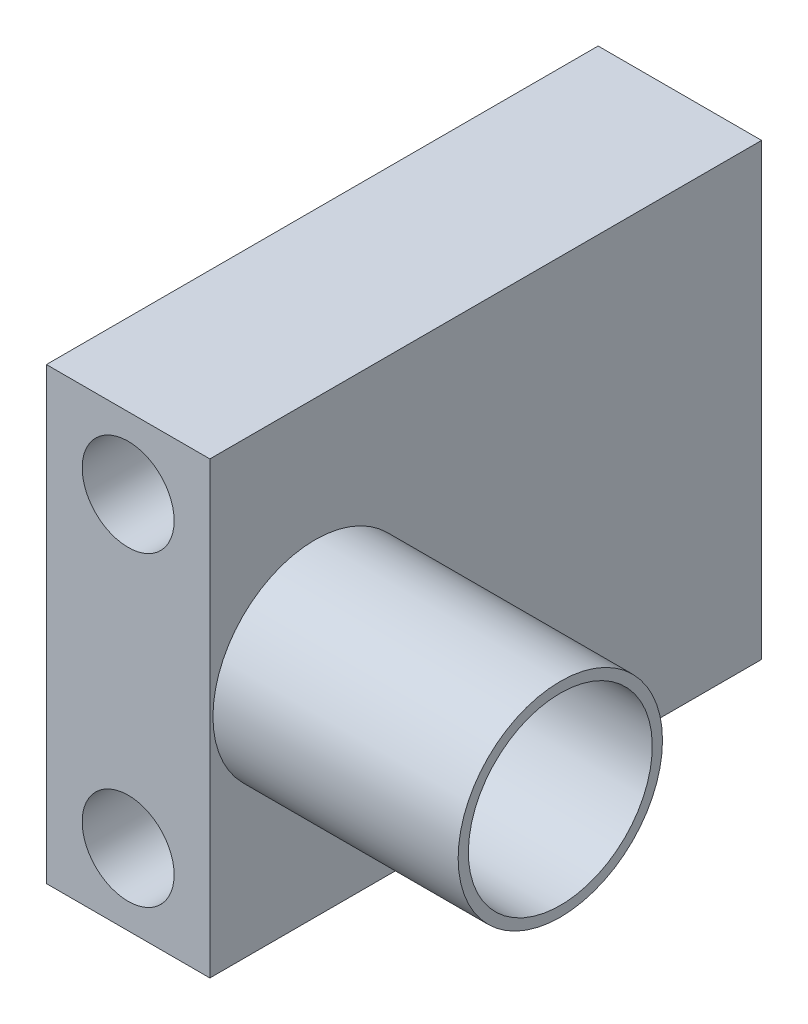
ISO-10303-21;
HEADER;
FILE_DESCRIPTION(('STEP AP214'),'2;1');
FILE_NAME('part.step','',(''),(''),'','','');
FILE_SCHEMA(('AUTOMOTIVE_DESIGN { 1 0 10303 214 1 1 1 1 }'));
ENDSEC;
DATA;
#1=APPLICATION_CONTEXT('core data for automotive mechanical design processes');
#2=APPLICATION_PROTOCOL_DEFINITION('international standard','automotive_design',2000,#1);
#3=PRODUCT_CONTEXT('',#1,'mechanical');
#4=PRODUCT('Part','Part','',(#3));
#5=PRODUCT_RELATED_PRODUCT_CATEGORY('part','',(#4));
#6=PRODUCT_DEFINITION_FORMATION('','',#4);
#7=PRODUCT_DEFINITION_CONTEXT('part definition',#1,'design');
#8=PRODUCT_DEFINITION('design','',#6,#7);
#9=PRODUCT_DEFINITION_SHAPE('','',#8);
#10=(LENGTH_UNIT() NAMED_UNIT(*) SI_UNIT(.MILLI.,.METRE.));
#11=(NAMED_UNIT(*) PLANE_ANGLE_UNIT() SI_UNIT($,.RADIAN.));
#12=(NAMED_UNIT(*) SI_UNIT($,.STERADIAN.) SOLID_ANGLE_UNIT());
#13=UNCERTAINTY_MEASURE_WITH_UNIT(LENGTH_MEASURE(1.E-05),#10,'distance_accuracy_value','');
#14=(GEOMETRIC_REPRESENTATION_CONTEXT(3) GLOBAL_UNCERTAINTY_ASSIGNED_CONTEXT((#13)) GLOBAL_UNIT_ASSIGNED_CONTEXT((#10,
#11,#12)) REPRESENTATION_CONTEXT('',''));
#15=CARTESIAN_POINT('',(0.,0.,0.));
#16=DIRECTION('',(0.,0.,1.));
#17=DIRECTION('',(1.,0.,0.));
#18=AXIS2_PLACEMENT_3D('',#15,#16,#17);
#19=CARTESIAN_POINT('',(8.,37.,54.));
#20=DIRECTION('',(-1.,0.,0.));
#21=DIRECTION('',(0.,-1.,0.));
#22=AXIS2_PLACEMENT_3D('',#19,#20,#21);
#23=PLANE('',#22);
#24=DIRECTION('',(0.,1.,0.));
#25=VECTOR('',#24,1.);
#26=CARTESIAN_POINT('',(8.,37.,0.));
#27=LINE('',#26,#25);
#28=CARTESIAN_POINT('',(8.,-7.,0.));
#29=VERTEX_POINT('',#28);
#30=CARTESIAN_POINT('',(8.,37.,0.));
#31=VERTEX_POINT('',#30);
#32=EDGE_CURVE('E62',#29,#31,#27,.T.);
#33=ORIENTED_EDGE('',*,*,#32,.T.);
#34=DIRECTION('',(0.,0.,-1.));
#35=VECTOR('',#34,1.);
#36=CARTESIAN_POINT('',(8.,37.,54.));
#37=LINE('',#36,#35);
#38=CARTESIAN_POINT('',(8.,37.,54.));
#39=VERTEX_POINT('',#38);
#40=EDGE_CURVE('E23',#39,#31,#37,.T.);
#41=ORIENTED_EDGE('',*,*,#40,.F.);
#42=DIRECTION('',(0.,1.,0.));
#43=VECTOR('',#42,1.);
#44=CARTESIAN_POINT('',(8.,37.,54.));
#45=LINE('',#44,#43);
#46=CARTESIAN_POINT('',(8.,-7.,54.));
#47=VERTEX_POINT('',#46);
#48=EDGE_CURVE('E88',#47,#39,#45,.T.);
#49=ORIENTED_EDGE('',*,*,#48,.F.);
#50=DIRECTION('',(0.,0.,-1.));
#51=VECTOR('',#50,1.);
#52=CARTESIAN_POINT('',(8.,-7.,54.));
#53=LINE('',#52,#51);
#54=EDGE_CURVE('E77',#47,#29,#53,.T.);
#55=ORIENTED_EDGE('',*,*,#54,.T.);
#56=EDGE_LOOP('',(#33,#41,#49,#55));
#57=FACE_BOUND('',#56,.T.);
#58=CARTESIAN_POINT('',(8.,15.,43.7));
#59=DIRECTION('',(-1.,0.,0.));
#60=DIRECTION('',(0.,-1.,0.));
#61=AXIS2_PLACEMENT_3D('',#58,#59,#60);
#62=CIRCLE('',#61,10.);
#63=CARTESIAN_POINT('',(8.,5.,43.7));
#64=VERTEX_POINT('',#63);
#65=EDGE_CURVE('E10',#64,#64,#62,.F.);
#66=ORIENTED_EDGE('',*,*,#65,.F.);
#67=EDGE_LOOP('',(#66));
#68=FACE_BOUND('',#67,.T.);
#69=ADVANCED_FACE('F15',(#57,#68),#23,.F.);
#70=CARTESIAN_POINT('',(8.,37.,54.));
#71=DIRECTION('',(0.,0.,-1.));
#72=DIRECTION('',(-1.,0.,0.));
#73=AXIS2_PLACEMENT_3D('',#70,#71,#72);
#74=PLANE('',#73);
#75=CARTESIAN_POINT('',(0.,30.,54.));
#76=DIRECTION('',(0.,0.,1.));
#77=DIRECTION('',(1.,0.,0.));
#78=AXIS2_PLACEMENT_3D('',#75,#76,#77);
#79=CIRCLE('',#78,4.5);
#80=CARTESIAN_POINT('',(4.5,30.,54.));
#81=VERTEX_POINT('',#80);
#82=EDGE_CURVE('E78',#81,#81,#79,.T.);
#83=ORIENTED_EDGE('',*,*,#82,.F.);
#84=EDGE_LOOP('',(#83));
#85=FACE_BOUND('',#84,.T.);
#86=ORIENTED_EDGE('',*,*,#48,.T.);
#87=DIRECTION('',(-1.,0.,0.));
#88=VECTOR('',#87,1.);
#89=CARTESIAN_POINT('',(8.,37.,54.));
#90=LINE('',#89,#88);
#91=CARTESIAN_POINT('',(-8.,37.,54.));
#92=VERTEX_POINT('',#91);
#93=EDGE_CURVE('E70',#39,#92,#90,.T.);
#94=ORIENTED_EDGE('',*,*,#93,.T.);
#95=DIRECTION('',(0.,-1.,0.));
#96=VECTOR('',#95,1.);
#97=CARTESIAN_POINT('',(-8.,37.,54.));
#98=LINE('',#97,#96);
#99=CARTESIAN_POINT('',(-8.,-7.,54.));
#100=VERTEX_POINT('',#99);
#101=EDGE_CURVE('E35',#92,#100,#98,.T.);
#102=ORIENTED_EDGE('',*,*,#101,.T.);
#103=DIRECTION('',(1.,0.,0.));
#104=VECTOR('',#103,1.);
#105=CARTESIAN_POINT('',(8.,-7.,54.));
#106=LINE('',#105,#104);
#107=EDGE_CURVE('E30',#100,#47,#106,.T.);
#108=ORIENTED_EDGE('',*,*,#107,.T.);
#109=EDGE_LOOP('',(#86,#94,#102,#108));
#110=FACE_BOUND('',#109,.T.);
#111=CARTESIAN_POINT('',(0.,0.,54.));
#112=DIRECTION('',(0.,0.,1.));
#113=DIRECTION('',(1.,0.,0.));
#114=AXIS2_PLACEMENT_3D('',#111,#112,#113);
#115=CIRCLE('',#114,4.5);
#116=CARTESIAN_POINT('',(4.5,0.,54.));
#117=VERTEX_POINT('',#116);
#118=EDGE_CURVE('E108',#117,#117,#115,.T.);
#119=ORIENTED_EDGE('',*,*,#118,.F.);
#120=EDGE_LOOP('',(#119));
#121=FACE_BOUND('',#120,.T.);
#122=ADVANCED_FACE('F101',(#85,#110,#121),#74,.F.);
#123=CARTESIAN_POINT('',(8.,37.,0.));
#124=DIRECTION('',(0.,0.,-1.));
#125=DIRECTION('',(-1.,0.,0.));
#126=AXIS2_PLACEMENT_3D('',#123,#124,#125);
#127=PLANE('',#126);
#128=CARTESIAN_POINT('',(0.,30.,0.));
#129=DIRECTION('',(0.,0.,1.));
#130=DIRECTION('',(1.,0.,0.));
#131=AXIS2_PLACEMENT_3D('',#128,#129,#130);
#132=CIRCLE('',#131,4.5);
#133=CARTESIAN_POINT('',(4.5,30.,0.));
#134=VERTEX_POINT('',#133);
#135=EDGE_CURVE('E81',#134,#134,#132,.T.);
#136=ORIENTED_EDGE('',*,*,#135,.T.);
#137=EDGE_LOOP('',(#136));
#138=FACE_BOUND('',#137,.T.);
#139=ORIENTED_EDGE('',*,*,#32,.F.);
#140=DIRECTION('',(1.,0.,0.));
#141=VECTOR('',#140,1.);
#142=CARTESIAN_POINT('',(8.,-7.,0.));
#143=LINE('',#142,#141);
#144=CARTESIAN_POINT('',(-8.,-7.,0.));
#145=VERTEX_POINT('',#144);
#146=EDGE_CURVE('E86',#145,#29,#143,.T.);
#147=ORIENTED_EDGE('',*,*,#146,.F.);
#148=DIRECTION('',(0.,-1.,0.));
#149=VECTOR('',#148,1.);
#150=CARTESIAN_POINT('',(-8.,37.,0.));
#151=LINE('',#150,#149);
#152=CARTESIAN_POINT('',(-8.,37.,0.));
#153=VERTEX_POINT('',#152);
#154=EDGE_CURVE('E63',#153,#145,#151,.T.);
#155=ORIENTED_EDGE('',*,*,#154,.F.);
#156=DIRECTION('',(-1.,0.,0.));
#157=VECTOR('',#156,1.);
#158=CARTESIAN_POINT('',(8.,37.,0.));
#159=LINE('',#158,#157);
#160=EDGE_CURVE('E56',#31,#153,#159,.T.);
#161=ORIENTED_EDGE('',*,*,#160,.F.);
#162=EDGE_LOOP('',(#139,#147,#155,#161));
#163=FACE_BOUND('',#162,.T.);
#164=CARTESIAN_POINT('',(0.,0.,0.));
#165=DIRECTION('',(0.,0.,1.));
#166=DIRECTION('',(1.,0.,0.));
#167=AXIS2_PLACEMENT_3D('',#164,#165,#166);
#168=CIRCLE('',#167,4.5);
#169=CARTESIAN_POINT('',(4.5,0.,0.));
#170=VERTEX_POINT('',#169);
#171=EDGE_CURVE('E110',#170,#170,#168,.T.);
#172=ORIENTED_EDGE('',*,*,#171,.T.);
#173=EDGE_LOOP('',(#172));
#174=FACE_BOUND('',#173,.T.);
#175=ADVANCED_FACE('F58',(#138,#163,#174),#127,.T.);
#176=CARTESIAN_POINT('',(8.,37.,54.));
#177=DIRECTION('',(0.,-1.,0.));
#178=DIRECTION('',(1.,0.,0.));
#179=AXIS2_PLACEMENT_3D('',#176,#177,#178);
#180=PLANE('',#179);
#181=ORIENTED_EDGE('',*,*,#160,.T.);
#182=DIRECTION('',(0.,0.,-1.));
#183=VECTOR('',#182,1.);
#184=CARTESIAN_POINT('',(-8.,37.,54.));
#185=LINE('',#184,#183);
#186=EDGE_CURVE('E73',#92,#153,#185,.T.);
#187=ORIENTED_EDGE('',*,*,#186,.F.);
#188=ORIENTED_EDGE('',*,*,#93,.F.);
#189=ORIENTED_EDGE('',*,*,#40,.T.);
#190=EDGE_LOOP('',(#181,#187,#188,#189));
#191=FACE_BOUND('',#190,.T.);
#192=ADVANCED_FACE('F69',(#191),#180,.F.);
#193=CARTESIAN_POINT('',(-8.,37.,54.));
#194=DIRECTION('',(1.,0.,0.));
#195=DIRECTION('',(0.,1.,0.));
#196=AXIS2_PLACEMENT_3D('',#193,#194,#195);
#197=PLANE('',#196);
#198=CARTESIAN_POINT('',(-8.,15.,43.7));
#199=DIRECTION('',(-1.,0.,0.));
#200=DIRECTION('',(0.,-1.,0.));
#201=AXIS2_PLACEMENT_3D('',#198,#199,#200);
#202=CIRCLE('',#201,6.25);
#203=CARTESIAN_POINT('',(-8.,8.75,43.7));
#204=VERTEX_POINT('',#203);
#205=EDGE_CURVE('E119',#204,#204,#202,.T.);
#206=ORIENTED_EDGE('',*,*,#205,.F.);
#207=EDGE_LOOP('',(#206));
#208=FACE_BOUND('',#207,.T.);
#209=ORIENTED_EDGE('',*,*,#154,.T.);
#210=DIRECTION('',(0.,0.,-1.));
#211=VECTOR('',#210,1.);
#212=CARTESIAN_POINT('',(-8.,-7.,54.));
#213=LINE('',#212,#211);
#214=EDGE_CURVE('E94',#100,#145,#213,.T.);
#215=ORIENTED_EDGE('',*,*,#214,.F.);
#216=ORIENTED_EDGE('',*,*,#101,.F.);
#217=ORIENTED_EDGE('',*,*,#186,.T.);
#218=EDGE_LOOP('',(#209,#215,#216,#217));
#219=FACE_BOUND('',#218,.T.);
#220=ADVANCED_FACE('F98',(#208,#219),#197,.F.);
#221=CARTESIAN_POINT('',(8.,-7.,54.));
#222=DIRECTION('',(0.,1.,0.));
#223=DIRECTION('',(0.,0.,1.));
#224=AXIS2_PLACEMENT_3D('',#221,#222,#223);
#225=PLANE('',#224);
#226=ORIENTED_EDGE('',*,*,#146,.T.);
#227=ORIENTED_EDGE('',*,*,#54,.F.);
#228=ORIENTED_EDGE('',*,*,#107,.F.);
#229=ORIENTED_EDGE('',*,*,#214,.T.);
#230=EDGE_LOOP('',(#226,#227,#228,#229));
#231=FACE_BOUND('',#230,.T.);
#232=ADVANCED_FACE('F100',(#231),#225,.F.);
#233=CARTESIAN_POINT('',(0.,30.,54.));
#234=DIRECTION('',(0.,0.,-1.));
#235=DIRECTION('',(-1.,0.,0.));
#236=AXIS2_PLACEMENT_3D('',#233,#234,#235);
#237=CYLINDRICAL_SURFACE('',#236,4.5);
#238=ORIENTED_EDGE('',*,*,#82,.T.);
#239=EDGE_LOOP('',(#238));
#240=FACE_BOUND('',#239,.T.);
#241=ORIENTED_EDGE('',*,*,#135,.F.);
#242=EDGE_LOOP('',(#241));
#243=FACE_BOUND('',#242,.T.);
#244=ADVANCED_FACE('F189',(#240,#243),#237,.F.);
#245=CARTESIAN_POINT('',(0.,0.,54.));
#246=DIRECTION('',(0.,0.,-1.));
#247=DIRECTION('',(-1.,0.,0.));
#248=AXIS2_PLACEMENT_3D('',#245,#246,#247);
#249=CYLINDRICAL_SURFACE('',#248,4.5);
#250=ORIENTED_EDGE('',*,*,#118,.T.);
#251=EDGE_LOOP('',(#250));
#252=FACE_BOUND('',#251,.T.);
#253=ORIENTED_EDGE('',*,*,#171,.F.);
#254=EDGE_LOOP('',(#253));
#255=FACE_BOUND('',#254,.T.);
#256=ADVANCED_FACE('F142',(#252,#255),#249,.F.);
#257=CARTESIAN_POINT('',(32.,15.,43.7));
#258=DIRECTION('',(-1.,0.,0.));
#259=DIRECTION('',(0.,-1.,0.));
#260=AXIS2_PLACEMENT_3D('',#257,#258,#259);
#261=CYLINDRICAL_SURFACE('',#260,10.);
#262=CARTESIAN_POINT('',(32.,15.,43.7));
#263=DIRECTION('',(1.,0.,0.));
#264=DIRECTION('',(0.,1.,0.));
#265=AXIS2_PLACEMENT_3D('',#262,#263,#264);
#266=CIRCLE('',#265,10.);
#267=CARTESIAN_POINT('',(32.,25.,43.7));
#268=VERTEX_POINT('',#267);
#269=EDGE_CURVE('E114',#268,#268,#266,.T.);
#270=ORIENTED_EDGE('',*,*,#269,.F.);
#271=EDGE_LOOP('',(#270));
#272=FACE_BOUND('',#271,.T.);
#273=ORIENTED_EDGE('',*,*,#65,.T.);
#274=EDGE_LOOP('',(#273));
#275=FACE_BOUND('',#274,.T.);
#276=ADVANCED_FACE('F136',(#272,#275),#261,.T.);
#277=CARTESIAN_POINT('',(32.,15.,43.7));
#278=DIRECTION('',(1.,0.,0.));
#279=DIRECTION('',(0.,1.,0.));
#280=AXIS2_PLACEMENT_3D('',#277,#278,#279);
#281=PLANE('',#280);
#282=CARTESIAN_POINT('',(32.,15.,43.7));
#283=DIRECTION('',(1.,0.,0.));
#284=DIRECTION('',(0.,1.,0.));
#285=AXIS2_PLACEMENT_3D('',#282,#283,#284);
#286=CIRCLE('',#285,9.);
#287=CARTESIAN_POINT('',(32.,24.,43.7));
#288=VERTEX_POINT('',#287);
#289=EDGE_CURVE('E125',#288,#288,#286,.T.);
#290=ORIENTED_EDGE('',*,*,#289,.F.);
#291=EDGE_LOOP('',(#290));
#292=FACE_BOUND('',#291,.T.);
#293=ORIENTED_EDGE('',*,*,#269,.T.);
#294=EDGE_LOOP('',(#293));
#295=FACE_BOUND('',#294,.T.);
#296=ADVANCED_FACE('F132',(#292,#295),#281,.T.);
#297=CARTESIAN_POINT('',(32.,15.,43.7));
#298=DIRECTION('',(-1.,0.,0.));
#299=DIRECTION('',(0.,-1.,0.));
#300=AXIS2_PLACEMENT_3D('',#297,#298,#299);
#301=CYLINDRICAL_SURFACE('',#300,6.25);
#302=CARTESIAN_POINT('',(9.,15.,43.7));
#303=DIRECTION('',(-1.,0.,0.));
#304=DIRECTION('',(0.,-1.,0.));
#305=AXIS2_PLACEMENT_3D('',#302,#303,#304);
#306=CIRCLE('',#305,6.25);
#307=CARTESIAN_POINT('',(9.,8.75,43.7));
#308=VERTEX_POINT('',#307);
#309=EDGE_CURVE('E18',#308,#308,#306,.F.);
#310=ORIENTED_EDGE('',*,*,#309,.T.);
#311=EDGE_LOOP('',(#310));
#312=FACE_BOUND('',#311,.T.);
#313=ORIENTED_EDGE('',*,*,#205,.T.);
#314=EDGE_LOOP('',(#313));
#315=FACE_BOUND('',#314,.T.);
#316=ADVANCED_FACE('F135',(#312,#315),#301,.F.);
#317=CARTESIAN_POINT('',(9.,37.,54.));
#318=DIRECTION('',(-1.,0.,0.));
#319=DIRECTION('',(0.,-1.,0.));
#320=AXIS2_PLACEMENT_3D('',#317,#318,#319);
#321=PLANE('',#320);
#322=CARTESIAN_POINT('',(9.,15.,43.7));
#323=DIRECTION('',(-1.,0.,0.));
#324=DIRECTION('',(0.,-1.,0.));
#325=AXIS2_PLACEMENT_3D('',#322,#323,#324);
#326=CIRCLE('',#325,9.);
#327=CARTESIAN_POINT('',(9.,6.,43.7));
#328=VERTEX_POINT('',#327);
#329=EDGE_CURVE('E122',#328,#328,#326,.F.);
#330=ORIENTED_EDGE('',*,*,#329,.T.);
#331=EDGE_LOOP('',(#330));
#332=FACE_BOUND('',#331,.T.);
#333=ORIENTED_EDGE('',*,*,#309,.F.);
#334=EDGE_LOOP('',(#333));
#335=FACE_BOUND('',#334,.T.);
#336=ADVANCED_FACE('F220',(#332,#335),#321,.F.);
#337=CARTESIAN_POINT('',(-17.4558441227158,15.,43.7));
#338=DIRECTION('',(1.,0.,0.));
#339=DIRECTION('',(0.,1.,0.));
#340=AXIS2_PLACEMENT_3D('',#337,#338,#339);
#341=CYLINDRICAL_SURFACE('',#340,9.);
#342=ORIENTED_EDGE('',*,*,#289,.T.);
#343=EDGE_LOOP('',(#342));
#344=FACE_BOUND('',#343,.T.);
#345=ORIENTED_EDGE('',*,*,#329,.F.);
#346=EDGE_LOOP('',(#345));
#347=FACE_BOUND('',#346,.T.);
#348=ADVANCED_FACE('F129',(#344,#347),#341,.F.);
#349=CLOSED_SHELL('',(#69,#122,#175,#192,#220,#232,#244,#256,#276,#296,#316,#336,#348));
#350=MANIFOLD_SOLID_BREP('B1',#349);
#351=ADVANCED_BREP_SHAPE_REPRESENTATION('',(#18,#350),#14);
#352=SHAPE_DEFINITION_REPRESENTATION(#9,#351);
ENDSEC;
END-ISO-10303-21;
